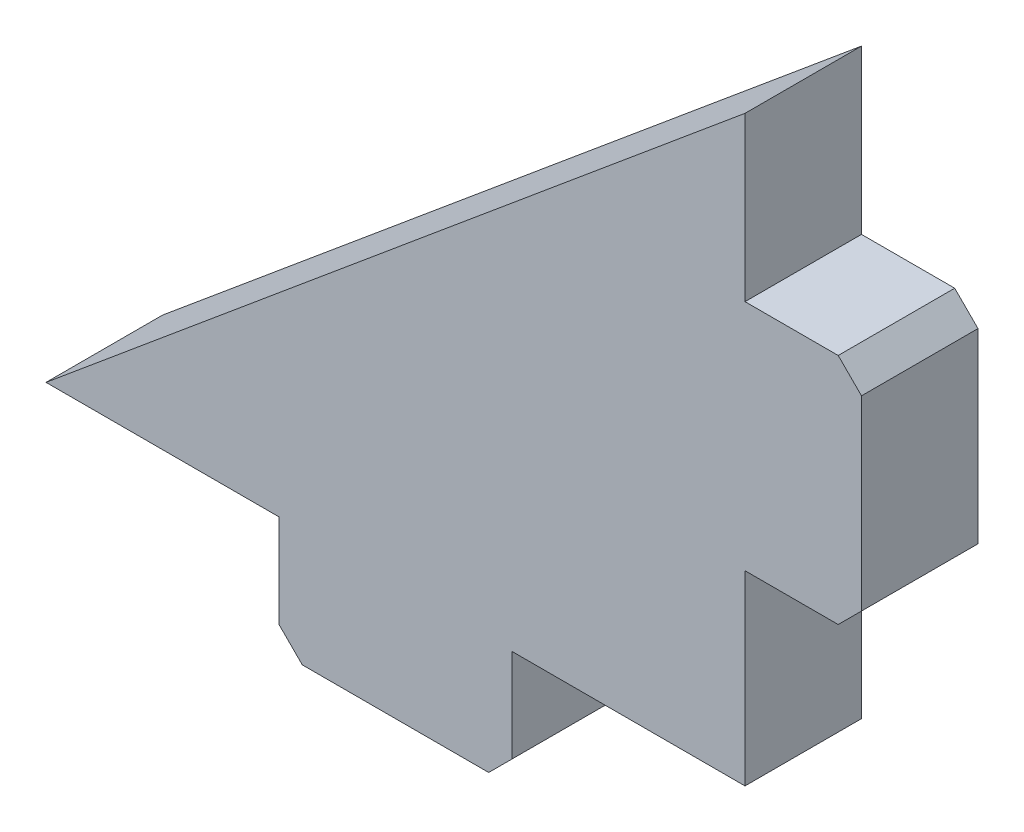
ISO-10303-21;
HEADER;
FILE_DESCRIPTION(('STEP AP214'),'2;1');
FILE_NAME('part.step','',(''),(''),'','','');
FILE_SCHEMA(('AUTOMOTIVE_DESIGN { 1 0 10303 214 1 1 1 1 }'));
ENDSEC;
DATA;
#1=APPLICATION_CONTEXT('core data for automotive mechanical design processes');
#2=APPLICATION_PROTOCOL_DEFINITION('international standard','automotive_design',2000,#1);
#3=PRODUCT_CONTEXT('',#1,'mechanical');
#4=PRODUCT('Part','Part','',(#3));
#5=PRODUCT_RELATED_PRODUCT_CATEGORY('part','',(#4));
#6=PRODUCT_DEFINITION_FORMATION('','',#4);
#7=PRODUCT_DEFINITION_CONTEXT('part definition',#1,'design');
#8=PRODUCT_DEFINITION('design','',#6,#7);
#9=PRODUCT_DEFINITION_SHAPE('','',#8);
#10=(LENGTH_UNIT() NAMED_UNIT(*) SI_UNIT(.MILLI.,.METRE.));
#11=(NAMED_UNIT(*) PLANE_ANGLE_UNIT() SI_UNIT($,.RADIAN.));
#12=(NAMED_UNIT(*) SI_UNIT($,.STERADIAN.) SOLID_ANGLE_UNIT());
#13=UNCERTAINTY_MEASURE_WITH_UNIT(LENGTH_MEASURE(1.E-05),#10,'distance_accuracy_value','');
#14=(GEOMETRIC_REPRESENTATION_CONTEXT(3) GLOBAL_UNCERTAINTY_ASSIGNED_CONTEXT((#13)) GLOBAL_UNIT_ASSIGNED_CONTEXT((#10,
#11,#12)) REPRESENTATION_CONTEXT('',''));
#15=CARTESIAN_POINT('',(0.,0.,0.));
#16=DIRECTION('',(0.,0.,1.));
#17=DIRECTION('',(1.,0.,0.));
#18=AXIS2_PLACEMENT_3D('',#15,#16,#17);
#19=CARTESIAN_POINT('',(0.,25.,5.));
#20=DIRECTION('',(0.64018439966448,-0.768221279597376,0.));
#21=DIRECTION('',(0.768221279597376,0.64018439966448,0.));
#22=AXIS2_PLACEMENT_3D('',#19,#20,#21);
#23=PLANE('',#22);
#24=DIRECTION('',(-0.768221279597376,-0.64018439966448,0.));
#25=VECTOR('',#24,1.);
#26=CARTESIAN_POINT('',(0.,25.,0.));
#27=LINE('',#26,#25);
#28=CARTESIAN_POINT('',(0.,25.,0.));
#29=VERTEX_POINT('',#28);
#30=CARTESIAN_POINT('',(-30.,0.,0.));
#31=VERTEX_POINT('',#30);
#32=EDGE_CURVE('E166',#29,#31,#27,.T.);
#33=ORIENTED_EDGE('',*,*,#32,.T.);
#34=DIRECTION('',(0.,0.,-1.));
#35=VECTOR('',#34,1.);
#36=CARTESIAN_POINT('',(-30.,0.,5.));
#37=LINE('',#36,#35);
#38=CARTESIAN_POINT('',(-30.,0.,5.));
#39=VERTEX_POINT('',#38);
#40=EDGE_CURVE('E146',#39,#31,#37,.T.);
#41=ORIENTED_EDGE('',*,*,#40,.F.);
#42=DIRECTION('',(-0.768221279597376,-0.64018439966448,0.));
#43=VECTOR('',#42,1.);
#44=CARTESIAN_POINT('',(0.,25.,5.));
#45=LINE('',#44,#43);
#46=CARTESIAN_POINT('',(0.,25.,5.));
#47=VERTEX_POINT('',#46);
#48=EDGE_CURVE('E153',#47,#39,#45,.T.);
#49=ORIENTED_EDGE('',*,*,#48,.F.);
#50=DIRECTION('',(0.,0.,-1.));
#51=VECTOR('',#50,1.);
#52=CARTESIAN_POINT('',(0.,25.,5.));
#53=LINE('',#52,#51);
#54=EDGE_CURVE('E224',#47,#29,#53,.T.);
#55=ORIENTED_EDGE('',*,*,#54,.T.);
#56=EDGE_LOOP('',(#33,#41,#49,#55));
#57=FACE_BOUND('',#56,.T.);
#58=ADVANCED_FACE('F35',(#57),#23,.F.);
#59=CARTESIAN_POINT('',(-30.,0.,5.));
#60=DIRECTION('',(0.,1.,0.));
#61=DIRECTION('',(0.,0.,1.));
#62=AXIS2_PLACEMENT_3D('',#59,#60,#61);
#63=PLANE('',#62);
#64=DIRECTION('',(1.,0.,0.));
#65=VECTOR('',#64,1.);
#66=CARTESIAN_POINT('',(-30.,0.,0.));
#67=LINE('',#66,#65);
#68=CARTESIAN_POINT('',(-20.,0.,0.));
#69=VERTEX_POINT('',#68);
#70=EDGE_CURVE('E256',#31,#69,#67,.T.);
#71=ORIENTED_EDGE('',*,*,#70,.T.);
#72=DIRECTION('',(0.,0.,-1.));
#73=VECTOR('',#72,1.);
#74=CARTESIAN_POINT('',(-20.,0.,5.));
#75=LINE('',#74,#73);
#76=CARTESIAN_POINT('',(-20.,0.,5.));
#77=VERTEX_POINT('',#76);
#78=EDGE_CURVE('E149',#77,#69,#75,.T.);
#79=ORIENTED_EDGE('',*,*,#78,.F.);
#80=DIRECTION('',(1.,0.,0.));
#81=VECTOR('',#80,1.);
#82=CARTESIAN_POINT('',(-30.,0.,5.));
#83=LINE('',#82,#81);
#84=EDGE_CURVE('E142',#39,#77,#83,.T.);
#85=ORIENTED_EDGE('',*,*,#84,.F.);
#86=ORIENTED_EDGE('',*,*,#40,.T.);
#87=EDGE_LOOP('',(#71,#79,#85,#86));
#88=FACE_BOUND('',#87,.T.);
#89=ADVANCED_FACE('F144',(#88),#63,.F.);
#90=CARTESIAN_POINT('',(-20.,0.,5.));
#91=DIRECTION('',(1.,0.,0.));
#92=DIRECTION('',(0.,0.,-1.));
#93=AXIS2_PLACEMENT_3D('',#90,#91,#92);
#94=PLANE('',#93);
#95=DIRECTION('',(0.,-1.,0.));
#96=VECTOR('',#95,1.);
#97=CARTESIAN_POINT('',(-20.,0.,0.));
#98=LINE('',#97,#96);
#99=CARTESIAN_POINT('',(-20.,-3.99999999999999,0.));
#100=VERTEX_POINT('',#99);
#101=EDGE_CURVE('E253',#69,#100,#98,.T.);
#102=ORIENTED_EDGE('',*,*,#101,.T.);
#103=DIRECTION('',(0.,0.,1.));
#104=VECTOR('',#103,1.);
#105=CARTESIAN_POINT('',(-20.,-3.99999999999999,5.));
#106=LINE('',#105,#104);
#107=CARTESIAN_POINT('',(-20.,-3.99999999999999,5.));
#108=VERTEX_POINT('',#107);
#109=EDGE_CURVE('E195',#100,#108,#106,.T.);
#110=ORIENTED_EDGE('',*,*,#109,.T.);
#111=DIRECTION('',(0.,-1.,0.));
#112=VECTOR('',#111,1.);
#113=CARTESIAN_POINT('',(-20.,0.,5.));
#114=LINE('',#113,#112);
#115=EDGE_CURVE('E152',#77,#108,#114,.T.);
#116=ORIENTED_EDGE('',*,*,#115,.F.);
#117=ORIENTED_EDGE('',*,*,#78,.T.);
#118=EDGE_LOOP('',(#102,#110,#116,#117));
#119=FACE_BOUND('',#118,.T.);
#120=ADVANCED_FACE('F309',(#119),#94,.F.);
#121=CARTESIAN_POINT('',(-20.,-5.,5.));
#122=DIRECTION('',(0.,1.,0.));
#123=DIRECTION('',(0.,0.,1.));
#124=AXIS2_PLACEMENT_3D('',#121,#122,#123);
#125=PLANE('',#124);
#126=DIRECTION('',(1.,0.,0.));
#127=VECTOR('',#126,1.);
#128=CARTESIAN_POINT('',(-20.,-5.,0.));
#129=LINE('',#128,#127);
#130=CARTESIAN_POINT('',(-19.,-5.,0.));
#131=VERTEX_POINT('',#130);
#132=CARTESIAN_POINT('',(-11.,-5.,0.));
#133=VERTEX_POINT('',#132);
#134=EDGE_CURVE('E248',#131,#133,#129,.T.);
#135=ORIENTED_EDGE('',*,*,#134,.T.);
#136=DIRECTION('',(0.,0.,1.));
#137=VECTOR('',#136,1.);
#138=CARTESIAN_POINT('',(-11.,-5.,5.));
#139=LINE('',#138,#137);
#140=CARTESIAN_POINT('',(-11.,-5.,5.));
#141=VERTEX_POINT('',#140);
#142=EDGE_CURVE('E186',#133,#141,#139,.T.);
#143=ORIENTED_EDGE('',*,*,#142,.T.);
#144=DIRECTION('',(1.,0.,0.));
#145=VECTOR('',#144,1.);
#146=CARTESIAN_POINT('',(-20.,-5.,5.));
#147=LINE('',#146,#145);
#148=CARTESIAN_POINT('',(-19.,-5.,5.));
#149=VERTEX_POINT('',#148);
#150=EDGE_CURVE('E271',#149,#141,#147,.T.);
#151=ORIENTED_EDGE('',*,*,#150,.F.);
#152=DIRECTION('',(0.,0.,-1.));
#153=VECTOR('',#152,1.);
#154=CARTESIAN_POINT('',(-19.,-5.,5.));
#155=LINE('',#154,#153);
#156=EDGE_CURVE('E183',#149,#131,#155,.T.);
#157=ORIENTED_EDGE('',*,*,#156,.T.);
#158=EDGE_LOOP('',(#135,#143,#151,#157));
#159=FACE_BOUND('',#158,.T.);
#160=ADVANCED_FACE('F282',(#159),#125,.F.);
#161=CARTESIAN_POINT('',(-10.,-5.,5.));
#162=DIRECTION('',(-1.,0.,0.));
#163=DIRECTION('',(0.,0.,1.));
#164=AXIS2_PLACEMENT_3D('',#161,#162,#163);
#165=PLANE('',#164);
#166=DIRECTION('',(0.,1.,0.));
#167=VECTOR('',#166,1.);
#168=CARTESIAN_POINT('',(-10.,-5.,5.));
#169=LINE('',#168,#167);
#170=CARTESIAN_POINT('',(-10.,-4.00000000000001,5.));
#171=VERTEX_POINT('',#170);
#172=CARTESIAN_POINT('',(-10.,0.,5.));
#173=VERTEX_POINT('',#172);
#174=EDGE_CURVE('E269',#171,#173,#169,.T.);
#175=ORIENTED_EDGE('',*,*,#174,.F.);
#176=DIRECTION('',(0.,0.,-1.));
#177=VECTOR('',#176,1.);
#178=CARTESIAN_POINT('',(-10.,-4.00000000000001,5.));
#179=LINE('',#178,#177);
#180=CARTESIAN_POINT('',(-10.,-4.00000000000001,0.));
#181=VERTEX_POINT('',#180);
#182=EDGE_CURVE('E167',#171,#181,#179,.T.);
#183=ORIENTED_EDGE('',*,*,#182,.T.);
#184=DIRECTION('',(0.,1.,0.));
#185=VECTOR('',#184,1.);
#186=CARTESIAN_POINT('',(-10.,-5.,0.));
#187=LINE('',#186,#185);
#188=CARTESIAN_POINT('',(-10.,0.,0.));
#189=VERTEX_POINT('',#188);
#190=EDGE_CURVE('E246',#181,#189,#187,.T.);
#191=ORIENTED_EDGE('',*,*,#190,.T.);
#192=DIRECTION('',(0.,0.,-1.));
#193=VECTOR('',#192,1.);
#194=CARTESIAN_POINT('',(-10.,0.,5.));
#195=LINE('',#194,#193);
#196=EDGE_CURVE('E172',#173,#189,#195,.T.);
#197=ORIENTED_EDGE('',*,*,#196,.F.);
#198=EDGE_LOOP('',(#175,#183,#191,#197));
#199=FACE_BOUND('',#198,.T.);
#200=ADVANCED_FACE('F289',(#199),#165,.F.);
#201=CARTESIAN_POINT('',(-10.,0.,5.));
#202=DIRECTION('',(0.,1.,0.));
#203=DIRECTION('',(0.,0.,1.));
#204=AXIS2_PLACEMENT_3D('',#201,#202,#203);
#205=PLANE('',#204);
#206=DIRECTION('',(1.,0.,0.));
#207=VECTOR('',#206,1.);
#208=CARTESIAN_POINT('',(-10.,0.,0.));
#209=LINE('',#208,#207);
#210=CARTESIAN_POINT('',(0.,0.,0.));
#211=VERTEX_POINT('',#210);
#212=EDGE_CURVE('E241',#189,#211,#209,.T.);
#213=ORIENTED_EDGE('',*,*,#212,.T.);
#214=DIRECTION('',(0.,0.,-1.));
#215=VECTOR('',#214,1.);
#216=CARTESIAN_POINT('',(0.,0.,5.));
#217=LINE('',#216,#215);
#218=CARTESIAN_POINT('',(0.,0.,5.));
#219=VERTEX_POINT('',#218);
#220=EDGE_CURVE('E232',#219,#211,#217,.T.);
#221=ORIENTED_EDGE('',*,*,#220,.F.);
#222=DIRECTION('',(1.,0.,0.));
#223=VECTOR('',#222,1.);
#224=CARTESIAN_POINT('',(-10.,0.,5.));
#225=LINE('',#224,#223);
#226=EDGE_CURVE('E242',#173,#219,#225,.T.);
#227=ORIENTED_EDGE('',*,*,#226,.F.);
#228=ORIENTED_EDGE('',*,*,#196,.T.);
#229=EDGE_LOOP('',(#213,#221,#227,#228));
#230=FACE_BOUND('',#229,.T.);
#231=ADVANCED_FACE('F239',(#230),#205,.F.);
#232=CARTESIAN_POINT('',(0.,0.,5.));
#233=DIRECTION('',(-1.,0.,0.));
#234=DIRECTION('',(0.,0.,1.));
#235=AXIS2_PLACEMENT_3D('',#232,#233,#234);
#236=PLANE('',#235);
#237=DIRECTION('',(0.,1.,0.));
#238=VECTOR('',#237,1.);
#239=CARTESIAN_POINT('',(0.,0.,0.));
#240=LINE('',#239,#238);
#241=CARTESIAN_POINT('',(0.,8.,0.));
#242=VERTEX_POINT('',#241);
#243=EDGE_CURVE('E219',#211,#242,#240,.T.);
#244=ORIENTED_EDGE('',*,*,#243,.T.);
#245=DIRECTION('',(0.,0.,-1.));
#246=VECTOR('',#245,1.);
#247=CARTESIAN_POINT('',(0.,8.,5.));
#248=LINE('',#247,#246);
#249=CARTESIAN_POINT('',(0.,8.,5.));
#250=VERTEX_POINT('',#249);
#251=EDGE_CURVE('E229',#250,#242,#248,.T.);
#252=ORIENTED_EDGE('',*,*,#251,.F.);
#253=DIRECTION('',(0.,1.,0.));
#254=VECTOR('',#253,1.);
#255=CARTESIAN_POINT('',(0.,0.,5.));
#256=LINE('',#255,#254);
#257=EDGE_CURVE('E266',#219,#250,#256,.T.);
#258=ORIENTED_EDGE('',*,*,#257,.F.);
#259=ORIENTED_EDGE('',*,*,#220,.T.);
#260=EDGE_LOOP('',(#244,#252,#258,#259));
#261=FACE_BOUND('',#260,.T.);
#262=ADVANCED_FACE('F293',(#261),#236,.F.);
#263=CARTESIAN_POINT('',(0.,8.,5.));
#264=DIRECTION('',(0.,1.,0.));
#265=DIRECTION('',(0.,0.,1.));
#266=AXIS2_PLACEMENT_3D('',#263,#264,#265);
#267=PLANE('',#266);
#268=DIRECTION('',(1.,0.,0.));
#269=VECTOR('',#268,1.);
#270=CARTESIAN_POINT('',(0.,8.,0.));
#271=LINE('',#270,#269);
#272=CARTESIAN_POINT('',(3.99999999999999,8.,0.));
#273=VERTEX_POINT('',#272);
#274=EDGE_CURVE('E216',#242,#273,#271,.T.);
#275=ORIENTED_EDGE('',*,*,#274,.T.);
#276=DIRECTION('',(0.,0.,1.));
#277=VECTOR('',#276,1.);
#278=CARTESIAN_POINT('',(3.99999999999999,8.,5.));
#279=LINE('',#278,#277);
#280=CARTESIAN_POINT('',(3.99999999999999,8.,5.));
#281=VERTEX_POINT('',#280);
#282=EDGE_CURVE('E11',#273,#281,#279,.T.);
#283=ORIENTED_EDGE('',*,*,#282,.T.);
#284=DIRECTION('',(1.,0.,0.));
#285=VECTOR('',#284,1.);
#286=CARTESIAN_POINT('',(0.,8.,5.));
#287=LINE('',#286,#285);
#288=EDGE_CURVE('E263',#250,#281,#287,.T.);
#289=ORIENTED_EDGE('',*,*,#288,.F.);
#290=ORIENTED_EDGE('',*,*,#251,.T.);
#291=EDGE_LOOP('',(#275,#283,#289,#290));
#292=FACE_BOUND('',#291,.T.);
#293=ADVANCED_FACE('F296',(#292),#267,.F.);
#294=CARTESIAN_POINT('',(5.,8.,5.));
#295=DIRECTION('',(-1.,0.,0.));
#296=DIRECTION('',(0.,-1.,0.));
#297=AXIS2_PLACEMENT_3D('',#294,#295,#296);
#298=PLANE('',#297);
#299=DIRECTION('',(0.,1.,0.));
#300=VECTOR('',#299,1.);
#301=CARTESIAN_POINT('',(5.,8.,0.));
#302=LINE('',#301,#300);
#303=CARTESIAN_POINT('',(5.,9.00000000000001,0.));
#304=VERTEX_POINT('',#303);
#305=CARTESIAN_POINT('',(5.,17.,0.));
#306=VERTEX_POINT('',#305);
#307=EDGE_CURVE('E205',#304,#306,#302,.T.);
#308=ORIENTED_EDGE('',*,*,#307,.T.);
#309=DIRECTION('',(0.,0.,1.));
#310=VECTOR('',#309,1.);
#311=CARTESIAN_POINT('',(5.,17.,5.));
#312=LINE('',#311,#310);
#313=CARTESIAN_POINT('',(5.,17.,5.));
#314=VERTEX_POINT('',#313);
#315=EDGE_CURVE('E43',#306,#314,#312,.T.);
#316=ORIENTED_EDGE('',*,*,#315,.T.);
#317=DIRECTION('',(0.,1.,0.));
#318=VECTOR('',#317,1.);
#319=CARTESIAN_POINT('',(5.,8.,5.));
#320=LINE('',#319,#318);
#321=CARTESIAN_POINT('',(5.,9.00000000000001,5.));
#322=VERTEX_POINT('',#321);
#323=EDGE_CURVE('E206',#322,#314,#320,.T.);
#324=ORIENTED_EDGE('',*,*,#323,.F.);
#325=DIRECTION('',(0.,0.,-1.));
#326=VECTOR('',#325,1.);
#327=CARTESIAN_POINT('',(5.,9.00000000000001,5.));
#328=LINE('',#327,#326);
#329=EDGE_CURVE('E200',#322,#304,#328,.T.);
#330=ORIENTED_EDGE('',*,*,#329,.T.);
#331=EDGE_LOOP('',(#308,#316,#324,#330));
#332=FACE_BOUND('',#331,.T.);
#333=ADVANCED_FACE('F204',(#332),#298,.F.);
#334=CARTESIAN_POINT('',(5.,18.,5.));
#335=DIRECTION('',(0.,-1.,0.));
#336=DIRECTION('',(0.,0.,-1.));
#337=AXIS2_PLACEMENT_3D('',#334,#335,#336);
#338=PLANE('',#337);
#339=DIRECTION('',(-1.,0.,0.));
#340=VECTOR('',#339,1.);
#341=CARTESIAN_POINT('',(5.,18.,5.));
#342=LINE('',#341,#340);
#343=CARTESIAN_POINT('',(4.00000000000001,18.,5.));
#344=VERTEX_POINT('',#343);
#345=CARTESIAN_POINT('',(0.,18.,5.));
#346=VERTEX_POINT('',#345);
#347=EDGE_CURVE('E260',#344,#346,#342,.T.);
#348=ORIENTED_EDGE('',*,*,#347,.F.);
#349=DIRECTION('',(0.,0.,-1.));
#350=VECTOR('',#349,1.);
#351=CARTESIAN_POINT('',(4.00000000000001,18.,5.));
#352=LINE('',#351,#350);
#353=CARTESIAN_POINT('',(4.00000000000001,18.,0.));
#354=VERTEX_POINT('',#353);
#355=EDGE_CURVE('E197',#344,#354,#352,.T.);
#356=ORIENTED_EDGE('',*,*,#355,.T.);
#357=DIRECTION('',(-1.,0.,0.));
#358=VECTOR('',#357,1.);
#359=CARTESIAN_POINT('',(5.,18.,0.));
#360=LINE('',#359,#358);
#361=CARTESIAN_POINT('',(0.,18.,0.));
#362=VERTEX_POINT('',#361);
#363=EDGE_CURVE('E215',#354,#362,#360,.T.);
#364=ORIENTED_EDGE('',*,*,#363,.T.);
#365=DIRECTION('',(0.,0.,-1.));
#366=VECTOR('',#365,1.);
#367=CARTESIAN_POINT('',(0.,18.,5.));
#368=LINE('',#367,#366);
#369=EDGE_CURVE('E226',#346,#362,#368,.T.);
#370=ORIENTED_EDGE('',*,*,#369,.F.);
#371=EDGE_LOOP('',(#348,#356,#364,#370));
#372=FACE_BOUND('',#371,.T.);
#373=ADVANCED_FACE('F360',(#372),#338,.F.);
#374=CARTESIAN_POINT('',(0.,18.,5.));
#375=DIRECTION('',(-1.,0.,0.));
#376=DIRECTION('',(0.,0.,1.));
#377=AXIS2_PLACEMENT_3D('',#374,#375,#376);
#378=PLANE('',#377);
#379=DIRECTION('',(0.,1.,0.));
#380=VECTOR('',#379,1.);
#381=CARTESIAN_POINT('',(0.,18.,0.));
#382=LINE('',#381,#380);
#383=EDGE_CURVE('E163',#362,#29,#382,.T.);
#384=ORIENTED_EDGE('',*,*,#383,.T.);
#385=ORIENTED_EDGE('',*,*,#54,.F.);
#386=DIRECTION('',(0.,1.,0.));
#387=VECTOR('',#386,1.);
#388=CARTESIAN_POINT('',(0.,18.,5.));
#389=LINE('',#388,#387);
#390=EDGE_CURVE('E159',#346,#47,#389,.T.);
#391=ORIENTED_EDGE('',*,*,#390,.F.);
#392=ORIENTED_EDGE('',*,*,#369,.T.);
#393=EDGE_LOOP('',(#384,#385,#391,#392));
#394=FACE_BOUND('',#393,.T.);
#395=ADVANCED_FACE('F351',(#394),#378,.F.);
#396=CARTESIAN_POINT('',(0.,0.,5.));
#397=DIRECTION('',(0.,0.,1.));
#398=DIRECTION('',(1.,0.,0.));
#399=AXIS2_PLACEMENT_3D('',#396,#397,#398);
#400=PLANE('',#399);
#401=ORIENTED_EDGE('',*,*,#150,.T.);
#402=DIRECTION('',(-0.707106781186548,-0.707106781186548,0.));
#403=VECTOR('',#402,1.);
#404=CARTESIAN_POINT('',(-3.,3.,5.));
#405=LINE('',#404,#403);
#406=EDGE_CURVE('E193',#141,#171,#405,.F.);
#407=ORIENTED_EDGE('',*,*,#406,.T.);
#408=ORIENTED_EDGE('',*,*,#174,.T.);
#409=ORIENTED_EDGE('',*,*,#226,.T.);
#410=ORIENTED_EDGE('',*,*,#257,.T.);
#411=ORIENTED_EDGE('',*,*,#288,.T.);
#412=DIRECTION('',(-0.70710678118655,-0.707106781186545,0.));
#413=VECTOR('',#412,1.);
#414=CARTESIAN_POINT('',(-2.00000000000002,2.00000000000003,5.));
#415=LINE('',#414,#413);
#416=EDGE_CURVE('E188',#281,#322,#415,.F.);
#417=ORIENTED_EDGE('',*,*,#416,.T.);
#418=ORIENTED_EDGE('',*,*,#323,.T.);
#419=DIRECTION('',(0.707106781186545,-0.70710678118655,0.));
#420=VECTOR('',#419,1.);
#421=CARTESIAN_POINT('',(11.,10.9999999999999,5.));
#422=LINE('',#421,#420);
#423=EDGE_CURVE('E50',#314,#344,#422,.F.);
#424=ORIENTED_EDGE('',*,*,#423,.T.);
#425=ORIENTED_EDGE('',*,*,#347,.T.);
#426=ORIENTED_EDGE('',*,*,#390,.T.);
#427=ORIENTED_EDGE('',*,*,#48,.T.);
#428=ORIENTED_EDGE('',*,*,#84,.T.);
#429=ORIENTED_EDGE('',*,*,#115,.T.);
#430=DIRECTION('',(-0.707106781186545,0.70710678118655,0.));
#431=VECTOR('',#430,1.);
#432=CARTESIAN_POINT('',(-12.0000000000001,-12.,5.));
#433=LINE('',#432,#431);
#434=EDGE_CURVE('E191',#108,#149,#433,.F.);
#435=ORIENTED_EDGE('',*,*,#434,.T.);
#436=EDGE_LOOP('',(#401,#407,#408,#409,#410,#411,#417,#418,#424,#425,#426,#427,#428,#429,#435));
#437=FACE_BOUND('',#436,.T.);
#438=ADVANCED_FACE('F157',(#437),#400,.T.);
#439=CARTESIAN_POINT('',(0.,0.,0.));
#440=DIRECTION('',(0.,0.,1.));
#441=DIRECTION('',(1.,0.,0.));
#442=AXIS2_PLACEMENT_3D('',#439,#440,#441);
#443=PLANE('',#442);
#444=ORIENTED_EDGE('',*,*,#190,.F.);
#445=DIRECTION('',(0.707106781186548,0.707106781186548,0.));
#446=VECTOR('',#445,1.);
#447=CARTESIAN_POINT('',(-10.,-4.00000000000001,0.));
#448=LINE('',#447,#446);
#449=EDGE_CURVE('E181',#181,#133,#448,.F.);
#450=ORIENTED_EDGE('',*,*,#449,.T.);
#451=ORIENTED_EDGE('',*,*,#134,.F.);
#452=DIRECTION('',(0.707106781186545,-0.70710678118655,0.));
#453=VECTOR('',#452,1.);
#454=CARTESIAN_POINT('',(-19.,-5.,0.));
#455=LINE('',#454,#453);
#456=EDGE_CURVE('E179',#131,#100,#455,.F.);
#457=ORIENTED_EDGE('',*,*,#456,.T.);
#458=ORIENTED_EDGE('',*,*,#101,.F.);
#459=ORIENTED_EDGE('',*,*,#70,.F.);
#460=ORIENTED_EDGE('',*,*,#32,.F.);
#461=ORIENTED_EDGE('',*,*,#383,.F.);
#462=ORIENTED_EDGE('',*,*,#363,.F.);
#463=DIRECTION('',(-0.707106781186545,0.70710678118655,0.));
#464=VECTOR('',#463,1.);
#465=CARTESIAN_POINT('',(4.00000000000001,18.,0.));
#466=LINE('',#465,#464);
#467=EDGE_CURVE('E177',#354,#306,#466,.F.);
#468=ORIENTED_EDGE('',*,*,#467,.T.);
#469=ORIENTED_EDGE('',*,*,#307,.F.);
#470=DIRECTION('',(0.70710678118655,0.707106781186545,0.));
#471=VECTOR('',#470,1.);
#472=CARTESIAN_POINT('',(5.,9.00000000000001,0.));
#473=LINE('',#472,#471);
#474=EDGE_CURVE('E170',#304,#273,#473,.F.);
#475=ORIENTED_EDGE('',*,*,#474,.T.);
#476=ORIENTED_EDGE('',*,*,#274,.F.);
#477=ORIENTED_EDGE('',*,*,#243,.F.);
#478=ORIENTED_EDGE('',*,*,#212,.F.);
#479=EDGE_LOOP('',(#444,#450,#451,#457,#458,#459,#460,#461,#462,#468,#469,#475,#476,#477,#478));
#480=FACE_BOUND('',#479,.T.);
#481=ADVANCED_FACE('F211',(#480),#443,.F.);
#482=CARTESIAN_POINT('',(-10.,-4.00000000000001,5.));
#483=DIRECTION('',(-0.707106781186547,0.707106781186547,0.));
#484=DIRECTION('',(0.,0.,-1.));
#485=AXIS2_PLACEMENT_3D('',#482,#483,#484);
#486=PLANE('',#485);
#487=ORIENTED_EDGE('',*,*,#406,.F.);
#488=ORIENTED_EDGE('',*,*,#142,.F.);
#489=ORIENTED_EDGE('',*,*,#449,.F.);
#490=ORIENTED_EDGE('',*,*,#182,.F.);
#491=EDGE_LOOP('',(#487,#488,#489,#490));
#492=FACE_BOUND('',#491,.T.);
#493=ADVANCED_FACE('F288',(#492),#486,.F.);
#494=CARTESIAN_POINT('',(-19.,-5.,5.));
#495=DIRECTION('',(0.70710678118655,0.707106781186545,0.));
#496=DIRECTION('',(0.,0.,-1.));
#497=AXIS2_PLACEMENT_3D('',#494,#495,#496);
#498=PLANE('',#497);
#499=ORIENTED_EDGE('',*,*,#434,.F.);
#500=ORIENTED_EDGE('',*,*,#109,.F.);
#501=ORIENTED_EDGE('',*,*,#456,.F.);
#502=ORIENTED_EDGE('',*,*,#156,.F.);
#503=EDGE_LOOP('',(#499,#500,#501,#502));
#504=FACE_BOUND('',#503,.T.);
#505=ADVANCED_FACE('F279',(#504),#498,.F.);
#506=CARTESIAN_POINT('',(4.00000000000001,18.,5.));
#507=DIRECTION('',(-0.70710678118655,-0.707106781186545,0.));
#508=DIRECTION('',(0.,0.,-1.));
#509=AXIS2_PLACEMENT_3D('',#506,#507,#508);
#510=PLANE('',#509);
#511=ORIENTED_EDGE('',*,*,#423,.F.);
#512=ORIENTED_EDGE('',*,*,#315,.F.);
#513=ORIENTED_EDGE('',*,*,#467,.F.);
#514=ORIENTED_EDGE('',*,*,#355,.F.);
#515=EDGE_LOOP('',(#511,#512,#513,#514));
#516=FACE_BOUND('',#515,.T.);
#517=ADVANCED_FACE('F299',(#516),#510,.F.);
#518=CARTESIAN_POINT('',(5.,9.00000000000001,5.));
#519=DIRECTION('',(-0.707106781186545,0.70710678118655,0.));
#520=DIRECTION('',(0.,0.,-1.));
#521=AXIS2_PLACEMENT_3D('',#518,#519,#520);
#522=PLANE('',#521);
#523=ORIENTED_EDGE('',*,*,#416,.F.);
#524=ORIENTED_EDGE('',*,*,#282,.F.);
#525=ORIENTED_EDGE('',*,*,#474,.F.);
#526=ORIENTED_EDGE('',*,*,#329,.F.);
#527=EDGE_LOOP('',(#523,#524,#525,#526));
#528=FACE_BOUND('',#527,.T.);
#529=ADVANCED_FACE('F37',(#528),#522,.F.);
#530=CLOSED_SHELL('',(#58,#89,#120,#160,#200,#231,#262,#293,#333,#373,#395,#438,#481,#493,#505,
#517,#529));
#531=MANIFOLD_SOLID_BREP('B2',#530);
#532=ADVANCED_BREP_SHAPE_REPRESENTATION('',(#18,#531),#14);
#533=SHAPE_DEFINITION_REPRESENTATION(#9,#532);
ENDSEC;
END-ISO-10303-21;
